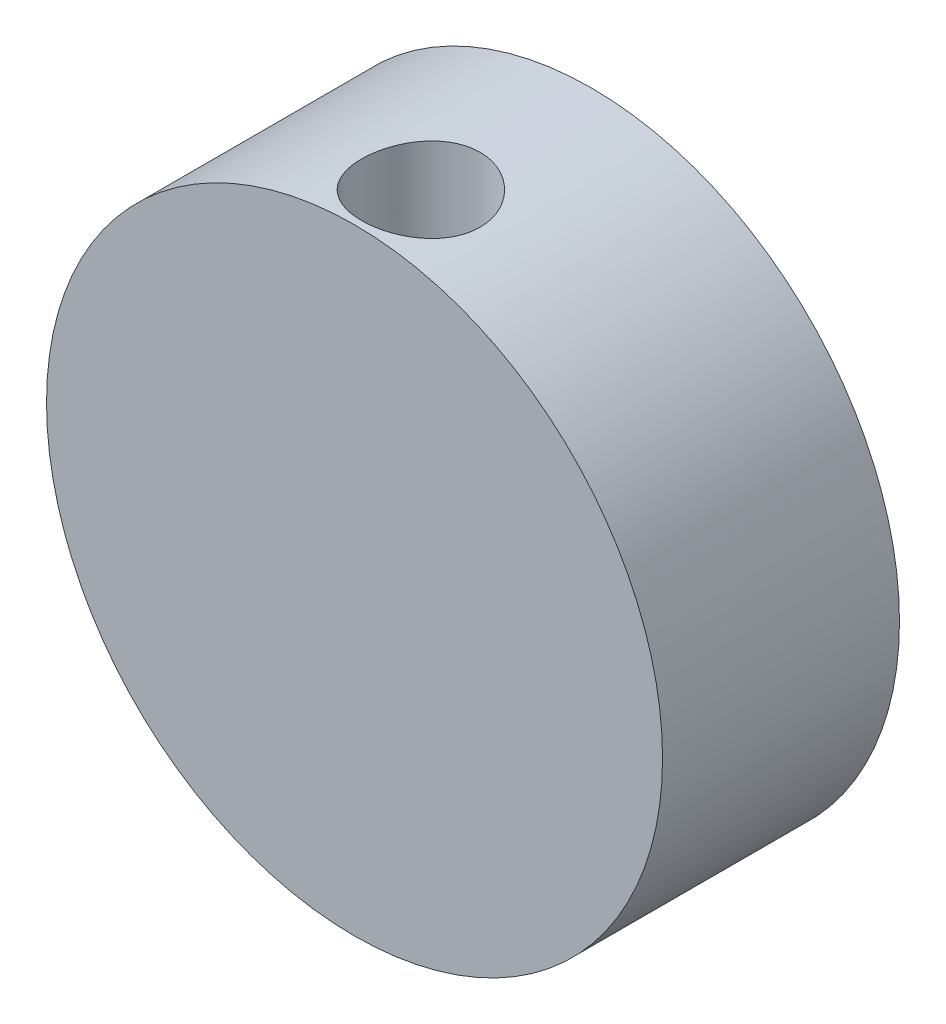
from build123d import *

# Parameters (mm, degrees)
SKETCH1_R           = 65
BOSS_EXTRUDE1_DEPTH = 50
SKETCH4_R           = 12.5
CUT_EXTRUDE3_DEPTH  = 66.5
SKETCH2_R           = 50
CUT_EXTRUDE4_DEPTH  = 10
SKETCH5_R           = 60
CUT_EXTRUDE5_DEPTH  = 10


with BuildPart() as part:
    # Sketch1 → Boss-Extrude1 (new body)
    with BuildSketch(Plane.XY):
        Circle(SKETCH1_R)
    extrude(amount=BOSS_EXTRUDE1_DEPTH)

    # Sketch4 → Cut-Extrude3 (cut, symmetric)
    with BuildSketch(Plane(origin=(0, 0, 0), x_dir=(1, 0, 0), z_dir=(0, 1, 0))):
        with Locations(Location((0, -36, 0), (0, 0, 270))):
            Circle(SKETCH4_R)
    extrude(amount=CUT_EXTRUDE3_DEPTH, both=True, mode=Mode.SUBTRACT)

    # Sketch2 → Cut-Extrude4 (cut)
    with BuildSketch(Plane(origin=(0, 0, 0), x_dir=(-1, 0, 0), z_dir=(0, 0, -1))):
        Circle(SKETCH2_R)
    extrude(amount=-CUT_EXTRUDE4_DEPTH, mode=Mode.SUBTRACT)

    # Sketch5 → Cut-Extrude5 (cut)
    with BuildSketch(Plane(origin=(0, 0, 10), x_dir=(-1, 0, 0), z_dir=(0, 0, -1))):
        Circle(SKETCH5_R)
    extrude(amount=-CUT_EXTRUDE5_DEPTH, mode=Mode.SUBTRACT)


solid = part.part
